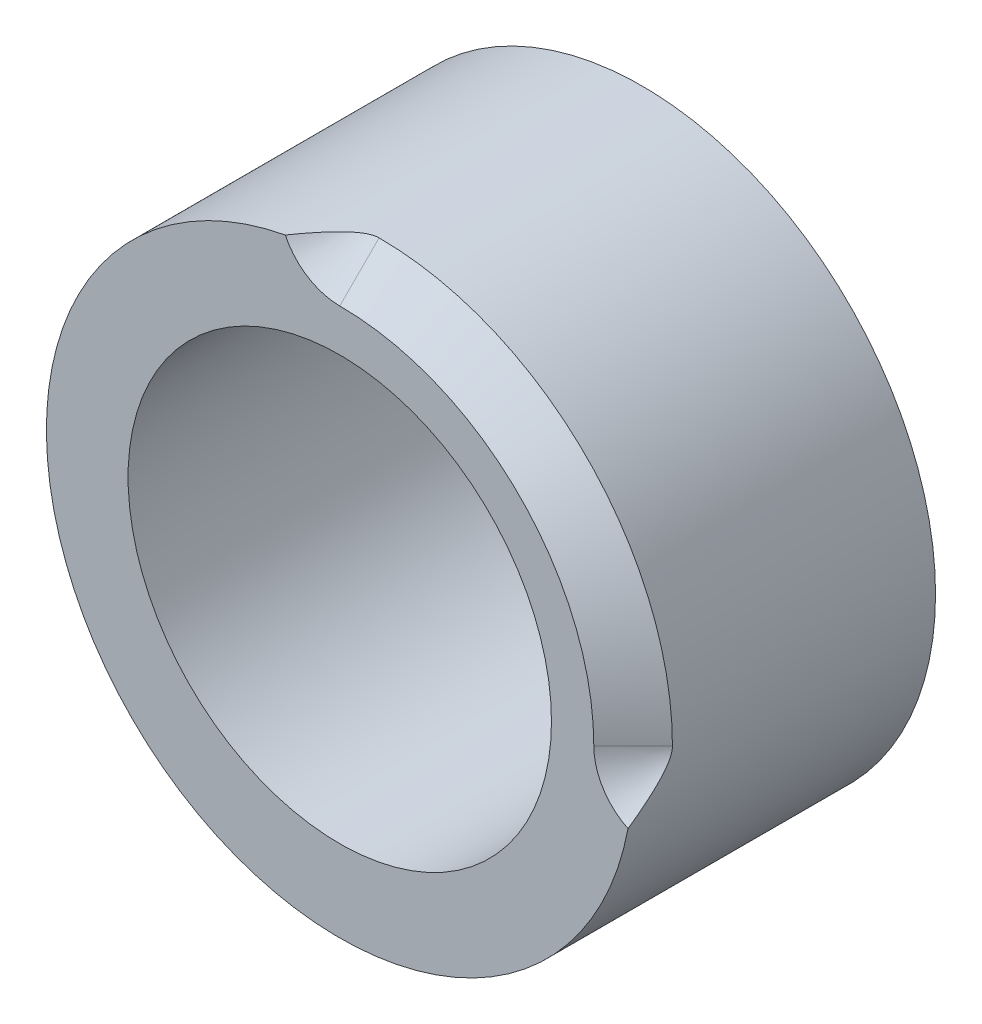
from build123d import *

# Parameters (mm, degrees)
SKIZZE1_R               = 48.5
SKIZZE1_R_2             = 35
LINEAR_AUSTRAGEN1_DEPTH = 50


with BuildPart() as part:
    # Skizze1 → Linear austragen1 (new body)
    with BuildSketch(Plane.XY):
        Circle(SKIZZE1_R)
        Circle(SKIZZE1_R_2, mode=Mode.SUBTRACT)
    extrude(amount=-LINEAR_AUSTRAGEN1_DEPTH)

    # Schnitt-Austragung1: sweep along a path in Skizze2
    with BuildLine(Plane.XY) as schnitt_austragung1_path:
        ThreePointArc((-10, 52), (-7.071067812, 44.928932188), (0, 42))
        ThreePointArc((0, 42), (29.69848481, 29.69848481), (42, 0))
        ThreePointArc((42, 0), (44.928932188, -7.071067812), (52, -10))
    # Skizze3 → Schnitt-Austragung1 (sweep, cut)
    with BuildSketch(Plane(origin=(52, -10, 0), x_dir=(0, 0, -1), z_dir=(1, 0, 0))):
        Polygon((-10, 10), (-10, -10), (10, 10), align=None)
    sweep(path=schnitt_austragung1_path.line, mode=Mode.SUBTRACT)


solid = part.part
